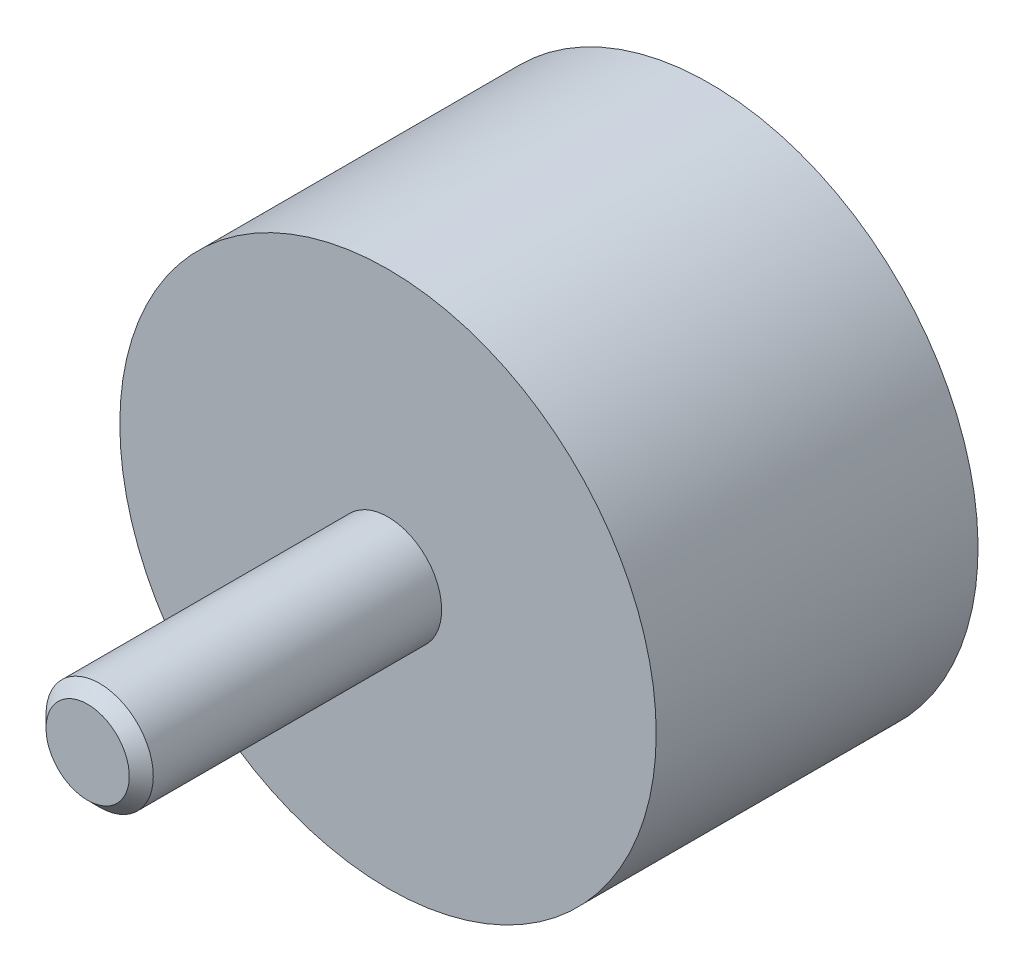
ISO-10303-21;
HEADER;
FILE_DESCRIPTION(('STEP AP214'),'2;1');
FILE_NAME('part.step','',(''),(''),'','','');
FILE_SCHEMA(('AUTOMOTIVE_DESIGN { 1 0 10303 214 1 1 1 1 }'));
ENDSEC;
DATA;
#1=APPLICATION_CONTEXT('core data for automotive mechanical design processes');
#2=APPLICATION_PROTOCOL_DEFINITION('international standard','automotive_design',2000,#1);
#3=PRODUCT_CONTEXT('',#1,'mechanical');
#4=PRODUCT('Part','Part','',(#3));
#5=PRODUCT_RELATED_PRODUCT_CATEGORY('part','',(#4));
#6=PRODUCT_DEFINITION_FORMATION('','',#4);
#7=PRODUCT_DEFINITION_CONTEXT('part definition',#1,'design');
#8=PRODUCT_DEFINITION('design','',#6,#7);
#9=PRODUCT_DEFINITION_SHAPE('','',#8);
#10=(LENGTH_UNIT() NAMED_UNIT(*) SI_UNIT(.MILLI.,.METRE.));
#11=(NAMED_UNIT(*) PLANE_ANGLE_UNIT() SI_UNIT($,.RADIAN.));
#12=(NAMED_UNIT(*) SI_UNIT($,.STERADIAN.) SOLID_ANGLE_UNIT());
#13=UNCERTAINTY_MEASURE_WITH_UNIT(LENGTH_MEASURE(1.E-05),#10,'distance_accuracy_value','');
#14=(GEOMETRIC_REPRESENTATION_CONTEXT(3) GLOBAL_UNCERTAINTY_ASSIGNED_CONTEXT((#13)) GLOBAL_UNIT_ASSIGNED_CONTEXT((#10,
#11,#12)) REPRESENTATION_CONTEXT('',''));
#15=CARTESIAN_POINT('',(0.,0.,0.));
#16=DIRECTION('',(0.,0.,1.));
#17=DIRECTION('',(1.,0.,0.));
#18=AXIS2_PLACEMENT_3D('',#15,#16,#17);
#19=CARTESIAN_POINT('',(0.,0.,0.));
#20=DIRECTION('',(0.,0.,1.));
#21=DIRECTION('',(0.,-1.,0.));
#22=AXIS2_PLACEMENT_3D('',#19,#20,#21);
#23=CYLINDRICAL_SURFACE('',#22,25.);
#24=CARTESIAN_POINT('',(0.,0.,0.));
#25=DIRECTION('',(0.,0.,1.));
#26=DIRECTION('',(0.,-1.,0.));
#27=AXIS2_PLACEMENT_3D('',#24,#25,#26);
#28=CIRCLE('',#27,25.);
#29=CARTESIAN_POINT('',(0.,-25.,0.));
#30=VERTEX_POINT('',#29);
#31=EDGE_CURVE('E18',#30,#30,#28,.T.);
#32=ORIENTED_EDGE('',*,*,#31,.T.);
#33=EDGE_LOOP('',(#32));
#34=FACE_BOUND('',#33,.T.);
#35=CARTESIAN_POINT('',(0.,0.,30.));
#36=DIRECTION('',(0.,0.,-1.));
#37=DIRECTION('',(0.,1.,0.));
#38=AXIS2_PLACEMENT_3D('',#35,#36,#37);
#39=CIRCLE('',#38,25.);
#40=CARTESIAN_POINT('',(0.,25.,30.));
#41=VERTEX_POINT('',#40);
#42=EDGE_CURVE('E22',#41,#41,#39,.T.);
#43=ORIENTED_EDGE('',*,*,#42,.T.);
#44=EDGE_LOOP('',(#43));
#45=FACE_BOUND('',#44,.T.);
#46=ADVANCED_FACE('F12',(#34,#45),#23,.T.);
#47=CARTESIAN_POINT('',(25.,0.,0.));
#48=DIRECTION('',(0.,0.,-1.));
#49=DIRECTION('',(0.,1.,0.));
#50=AXIS2_PLACEMENT_3D('',#47,#48,#49);
#51=PLANE('',#50);
#52=ORIENTED_EDGE('',*,*,#31,.F.);
#53=EDGE_LOOP('',(#52));
#54=FACE_BOUND('',#53,.T.);
#55=ADVANCED_FACE('F48',(#54),#51,.T.);
#56=CARTESIAN_POINT('',(25.,0.,30.));
#57=DIRECTION('',(0.,0.,1.));
#58=DIRECTION('',(0.,-1.,0.));
#59=AXIS2_PLACEMENT_3D('',#56,#57,#58);
#60=PLANE('',#59);
#61=CARTESIAN_POINT('',(0.,0.,30.));
#62=DIRECTION('',(0.,0.,1.));
#63=DIRECTION('',(0.,-1.,0.));
#64=AXIS2_PLACEMENT_3D('',#61,#62,#63);
#65=CIRCLE('',#64,5.);
#66=CARTESIAN_POINT('',(0.,-5.,30.));
#67=VERTEX_POINT('',#66);
#68=EDGE_CURVE('E8',#67,#67,#65,.F.);
#69=ORIENTED_EDGE('',*,*,#68,.T.);
#70=EDGE_LOOP('',(#69));
#71=FACE_BOUND('',#70,.T.);
#72=ORIENTED_EDGE('',*,*,#42,.F.);
#73=EDGE_LOOP('',(#72));
#74=FACE_BOUND('',#73,.T.);
#75=ADVANCED_FACE('F52',(#71,#74),#60,.T.);
#76=CARTESIAN_POINT('',(0.,0.,20.));
#77=DIRECTION('',(0.,0.,1.));
#78=DIRECTION('',(0.,-1.,0.));
#79=AXIS2_PLACEMENT_3D('',#76,#77,#78);
#80=CYLINDRICAL_SURFACE('',#79,5.);
#81=ORIENTED_EDGE('',*,*,#68,.F.);
#82=EDGE_LOOP('',(#81));
#83=FACE_BOUND('',#82,.T.);
#84=CARTESIAN_POINT('',(0.,0.,56.8809789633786));
#85=DIRECTION('',(0.,0.,-1.));
#86=DIRECTION('',(0.,1.,0.));
#87=AXIS2_PLACEMENT_3D('',#84,#85,#86);
#88=CIRCLE('',#87,5.);
#89=CARTESIAN_POINT('',(0.,5.,56.8809789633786));
#90=VERTEX_POINT('',#89);
#91=EDGE_CURVE('E26',#90,#90,#88,.T.);
#92=ORIENTED_EDGE('',*,*,#91,.T.);
#93=EDGE_LOOP('',(#92));
#94=FACE_BOUND('',#93,.T.);
#95=ADVANCED_FACE('F45',(#83,#94),#80,.T.);
#96=CARTESIAN_POINT('',(0.,0.,56.8809789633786));
#97=DIRECTION('',(0.,0.,-1.));
#98=DIRECTION('',(0.,1.,0.));
#99=AXIS2_PLACEMENT_3D('',#96,#97,#98);
#100=CONICAL_SURFACE('',#99,5.,0.785398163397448);
#101=CARTESIAN_POINT('',(0.,0.,58.));
#102=DIRECTION('',(0.,0.,-1.));
#103=DIRECTION('',(0.,1.,0.));
#104=AXIS2_PLACEMENT_3D('',#101,#102,#103);
#105=CIRCLE('',#104,3.88097896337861);
#106=CARTESIAN_POINT('',(0.,3.88097896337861,58.));
#107=VERTEX_POINT('',#106);
#108=EDGE_CURVE('E31',#107,#107,#105,.T.);
#109=ORIENTED_EDGE('',*,*,#108,.T.);
#110=EDGE_LOOP('',(#109));
#111=FACE_BOUND('',#110,.T.);
#112=ORIENTED_EDGE('',*,*,#91,.F.);
#113=EDGE_LOOP('',(#112));
#114=FACE_BOUND('',#113,.T.);
#115=ADVANCED_FACE('F35',(#111,#114),#100,.T.);
#116=CARTESIAN_POINT('',(3.88097896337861,0.,58.));
#117=DIRECTION('',(0.,0.,1.));
#118=DIRECTION('',(0.,-1.,0.));
#119=AXIS2_PLACEMENT_3D('',#116,#117,#118);
#120=PLANE('',#119);
#121=ORIENTED_EDGE('',*,*,#108,.F.);
#122=EDGE_LOOP('',(#121));
#123=FACE_BOUND('',#122,.T.);
#124=ADVANCED_FACE('F38',(#123),#120,.T.);
#125=CLOSED_SHELL('',(#46,#55,#75,#95,#115,#124));
#126=MANIFOLD_SOLID_BREP('B1',#125);
#127=ADVANCED_BREP_SHAPE_REPRESENTATION('',(#18,#126),#14);
#128=SHAPE_DEFINITION_REPRESENTATION(#9,#127);
ENDSEC;
END-ISO-10303-21;
